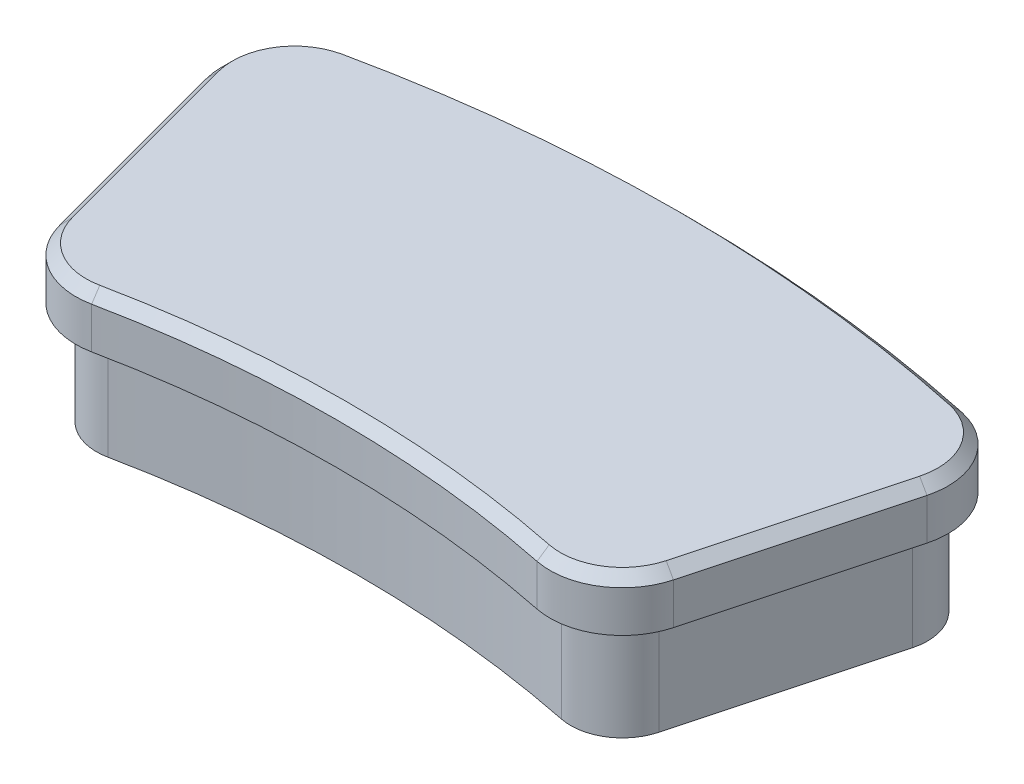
from build123d import *

# Parameters (mm, degrees)
BOSS_EXTRUDE1_DEPTH = 15
SKETCH5_OUTSIDE_W   = 92.294
SKETCH5_OUTSIDE_H   = 56.47
CUT_EXTRUDE2_DEPTH  = 10
FILLET1_R           = 5
FILLET2_R           = 7
CHAMFER1_SIZE       = 1


with BuildPart() as part:
    # Sketch1 → Boss-Extrude1 (new body)
    with BuildSketch(Plane(origin=(0, 0, 0), x_dir=(1, 0, 0), z_dir=(0, 1, 0))):
        with BuildLine():
            Line((-27.952456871, 104.319989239), (-36.752304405, 137.161467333))
            ThreePointArc((-36.752304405, 137.161467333), (0, 142), (36.752304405, 137.161467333))
            Line((36.752304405, 137.161467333), (27.952456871, 104.319989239))
            ThreePointArc((27.952456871, 104.319989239), (0, 108), (-27.952456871, 104.319989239))
        make_face()
    extrude(amount=BOSS_EXTRUDE1_DEPTH)

    # Sketch5 outside → Cut-Extrude2 (cut)
    with BuildSketch(Plane(origin=(0, 0, 0), x_dir=(1, 0, 0), z_dir=(0, 1, 0))):
        with Locations((0, 123.16)):
            Rectangle(SKETCH5_OUTSIDE_W, SKETCH5_OUTSIDE_H)
        with BuildLine():
            Line((-34.299117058, 135.733454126), (-26.533537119, 106.751915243))
            ThreePointArc((-26.533537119, 106.751915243), (0, 110), (26.533537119, 106.751915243))
            Line((26.533537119, 106.751915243), (34.299117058, 135.733454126))
            ThreePointArc((34.299117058, 135.733454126), (0, 140), (-34.299117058, 135.733454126))
        make_face(mode=Mode.SUBTRACT)
    extrude(amount=CUT_EXTRUDE2_DEPTH, mode=Mode.SUBTRACT)

    # Fillet1
    fillet1_edges = [part.edges().sort_by_distance(p)[0] for p in [
        (26.533537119, 5, -106.751915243),
        (34.299117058, 5, -135.733454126),
        (-34.299117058, 5, -135.733454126),
        (-26.533537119, 5, -106.751915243),
    ]]
    fillet(fillet1_edges, radius=FILLET1_R)

    # Fillet2
    fillet2_edges = [part.edges().sort_by_distance(p)[0] for p in [
        (-27.952456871, 12.5, -104.319989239),
        (-36.752304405, 12.5, -137.161467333),
        (36.752304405, 12.5, -137.161467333),
        (27.952456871, 12.5, -104.319989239),
    ]]
    fillet(fillet2_edges, radius=FILLET2_R)

    # Chamfer1
    chamfer1_edges = [part.edges().sort_by_distance(p)[0] for p in [
        (0, 15, -108),
        (-32.301283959, 15, -120.550032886),
        (32.301283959, 15, -120.550032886),
        (0, 15, -142),
        (34.101455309, 15, -135.692347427),
        (26.630482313, 15, -106.734432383),
        (-34.101455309, 15, -135.692347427),
        (-26.630482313, 15, -106.734432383),
    ]]
    chamfer(chamfer1_edges, length=CHAMFER1_SIZE)


solid = part.part
